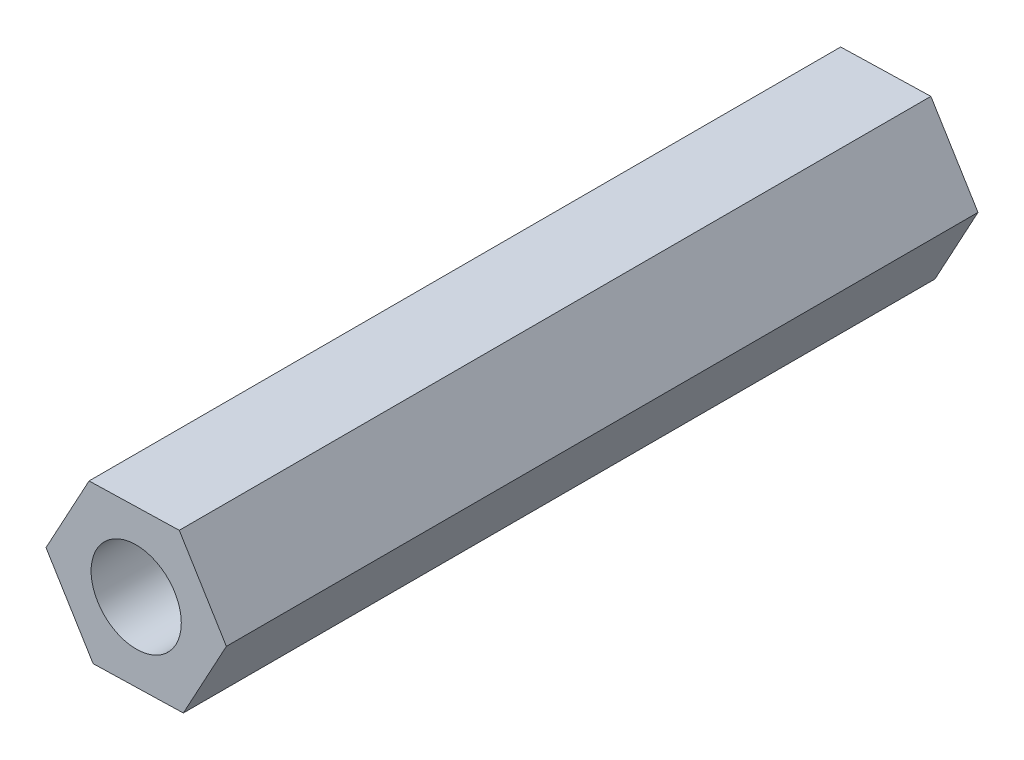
ISO-10303-21;
HEADER;
FILE_DESCRIPTION(('STEP AP214'),'2;1');
FILE_NAME('part.step','',(''),(''),'','','');
FILE_SCHEMA(('AUTOMOTIVE_DESIGN { 1 0 10303 214 1 1 1 1 }'));
ENDSEC;
DATA;
#1=APPLICATION_CONTEXT('core data for automotive mechanical design processes');
#2=APPLICATION_PROTOCOL_DEFINITION('international standard','automotive_design',2000,#1);
#3=PRODUCT_CONTEXT('',#1,'mechanical');
#4=PRODUCT('Part','Part','',(#3));
#5=PRODUCT_RELATED_PRODUCT_CATEGORY('part','',(#4));
#6=PRODUCT_DEFINITION_FORMATION('','',#4);
#7=PRODUCT_DEFINITION_CONTEXT('part definition',#1,'design');
#8=PRODUCT_DEFINITION('design','',#6,#7);
#9=PRODUCT_DEFINITION_SHAPE('','',#8);
#10=(LENGTH_UNIT() NAMED_UNIT(*) SI_UNIT(.MILLI.,.METRE.));
#11=(NAMED_UNIT(*) PLANE_ANGLE_UNIT() SI_UNIT($,.RADIAN.));
#12=(NAMED_UNIT(*) SI_UNIT($,.STERADIAN.) SOLID_ANGLE_UNIT());
#13=UNCERTAINTY_MEASURE_WITH_UNIT(LENGTH_MEASURE(1.E-05),#10,'distance_accuracy_value','');
#14=(GEOMETRIC_REPRESENTATION_CONTEXT(3) GLOBAL_UNCERTAINTY_ASSIGNED_CONTEXT((#13)) GLOBAL_UNIT_ASSIGNED_CONTEXT((#10,
#11,#12)) REPRESENTATION_CONTEXT('',''));
#15=CARTESIAN_POINT('',(0.,0.,0.));
#16=DIRECTION('',(0.,0.,1.));
#17=DIRECTION('',(1.,0.,0.));
#18=AXIS2_PLACEMENT_3D('',#15,#16,#17);
#19=CARTESIAN_POINT('',(1.56754599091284,-2.55907851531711,25.));
#20=DIRECTION('',(0.0259896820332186,-0.999662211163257,0.));
#21=DIRECTION('',(0.999662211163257,0.0259896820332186,0.));
#22=AXIS2_PLACEMENT_3D('',#19,#20,#21);
#23=PLANE('',#22);
#24=DIRECTION('',(-0.999662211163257,-0.0259896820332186,0.));
#25=VECTOR('',#24,1.);
#26=CARTESIAN_POINT('',(1.56754599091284,-2.55907851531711,0.));
#27=LINE('',#26,#25);
#28=CARTESIAN_POINT('',(1.56754599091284,-2.55907851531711,0.));
#29=VERTEX_POINT('',#28);
#30=CARTESIAN_POINT('',(-1.43245400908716,-2.63707390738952,0.));
#31=VERTEX_POINT('',#30);
#32=EDGE_CURVE('E118',#29,#31,#27,.T.);
#33=ORIENTED_EDGE('',*,*,#32,.F.);
#34=DIRECTION('',(0.,0.,-1.));
#35=VECTOR('',#34,1.);
#36=CARTESIAN_POINT('',(1.56754599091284,-2.55907851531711,25.));
#37=LINE('',#36,#35);
#38=CARTESIAN_POINT('',(1.56754599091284,-2.55907851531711,25.));
#39=VERTEX_POINT('',#38);
#40=EDGE_CURVE('E11',#39,#29,#37,.T.);
#41=ORIENTED_EDGE('',*,*,#40,.F.);
#42=DIRECTION('',(-0.999662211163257,-0.0259896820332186,0.));
#43=VECTOR('',#42,1.);
#44=CARTESIAN_POINT('',(1.56754599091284,-2.55907851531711,25.));
#45=LINE('',#44,#43);
#46=CARTESIAN_POINT('',(-1.43245400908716,-2.63707390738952,25.));
#47=VERTEX_POINT('',#46);
#48=EDGE_CURVE('E133',#39,#47,#45,.T.);
#49=ORIENTED_EDGE('',*,*,#48,.T.);
#50=DIRECTION('',(0.,0.,-1.));
#51=VECTOR('',#50,1.);
#52=CARTESIAN_POINT('',(-1.43245400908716,-2.63707390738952,25.));
#53=LINE('',#52,#51);
#54=EDGE_CURVE('E36',#47,#31,#53,.T.);
#55=ORIENTED_EDGE('',*,*,#54,.T.);
#56=EDGE_LOOP('',(#33,#41,#49,#55));
#57=FACE_BOUND('',#56,.T.);
#58=ADVANCED_FACE('F33',(#57),#23,.T.);
#59=CARTESIAN_POINT('',(3.,0.0779953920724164,25.));
#60=DIRECTION('',(0.878727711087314,-0.477323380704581,0.));
#61=DIRECTION('',(0.477323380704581,0.878727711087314,0.));
#62=AXIS2_PLACEMENT_3D('',#59,#60,#61);
#63=PLANE('',#62);
#64=DIRECTION('',(-0.477323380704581,-0.878727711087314,0.));
#65=VECTOR('',#64,1.);
#66=CARTESIAN_POINT('',(3.,0.0779953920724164,0.));
#67=LINE('',#66,#65);
#68=CARTESIAN_POINT('',(3.,0.0779953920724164,0.));
#69=VERTEX_POINT('',#68);
#70=EDGE_CURVE('E131',#69,#29,#67,.T.);
#71=ORIENTED_EDGE('',*,*,#70,.F.);
#72=DIRECTION('',(0.,0.,-1.));
#73=VECTOR('',#72,1.);
#74=CARTESIAN_POINT('',(3.,0.0779953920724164,25.));
#75=LINE('',#74,#73);
#76=CARTESIAN_POINT('',(3.,0.0779953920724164,25.));
#77=VERTEX_POINT('',#76);
#78=EDGE_CURVE('E42',#77,#69,#75,.T.);
#79=ORIENTED_EDGE('',*,*,#78,.F.);
#80=DIRECTION('',(-0.477323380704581,-0.878727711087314,0.));
#81=VECTOR('',#80,1.);
#82=CARTESIAN_POINT('',(3.,0.0779953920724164,25.));
#83=LINE('',#82,#81);
#84=EDGE_CURVE('E108',#77,#39,#83,.T.);
#85=ORIENTED_EDGE('',*,*,#84,.T.);
#86=ORIENTED_EDGE('',*,*,#40,.T.);
#87=EDGE_LOOP('',(#71,#79,#85,#86));
#88=FACE_BOUND('',#87,.T.);
#89=ADVANCED_FACE('F141',(#88),#63,.T.);
#90=CARTESIAN_POINT('',(1.43245400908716,2.63707390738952,25.));
#91=DIRECTION('',(0.852738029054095,0.522338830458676,0.));
#92=DIRECTION('',(-0.522338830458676,0.852738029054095,0.));
#93=AXIS2_PLACEMENT_3D('',#90,#91,#92);
#94=PLANE('',#93);
#95=DIRECTION('',(0.522338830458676,-0.852738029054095,0.));
#96=VECTOR('',#95,1.);
#97=CARTESIAN_POINT('',(1.43245400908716,2.63707390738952,0.));
#98=LINE('',#97,#96);
#99=CARTESIAN_POINT('',(1.43245400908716,2.63707390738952,0.));
#100=VERTEX_POINT('',#99);
#101=EDGE_CURVE('E95',#100,#69,#98,.T.);
#102=ORIENTED_EDGE('',*,*,#101,.F.);
#103=DIRECTION('',(0.,0.,-1.));
#104=VECTOR('',#103,1.);
#105=CARTESIAN_POINT('',(1.43245400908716,2.63707390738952,25.));
#106=LINE('',#105,#104);
#107=CARTESIAN_POINT('',(1.43245400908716,2.63707390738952,25.));
#108=VERTEX_POINT('',#107);
#109=EDGE_CURVE('E90',#108,#100,#106,.T.);
#110=ORIENTED_EDGE('',*,*,#109,.F.);
#111=DIRECTION('',(0.522338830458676,-0.852738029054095,0.));
#112=VECTOR('',#111,1.);
#113=CARTESIAN_POINT('',(1.43245400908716,2.63707390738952,25.));
#114=LINE('',#113,#112);
#115=EDGE_CURVE('E93',#108,#77,#114,.T.);
#116=ORIENTED_EDGE('',*,*,#115,.T.);
#117=ORIENTED_EDGE('',*,*,#78,.T.);
#118=EDGE_LOOP('',(#102,#110,#116,#117));
#119=FACE_BOUND('',#118,.T.);
#120=ADVANCED_FACE('F92',(#119),#94,.T.);
#121=CARTESIAN_POINT('',(-1.56754599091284,2.55907851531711,25.));
#122=DIRECTION('',(-0.0259896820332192,0.999662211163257,0.));
#123=DIRECTION('',(-0.999662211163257,-0.0259896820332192,0.));
#124=AXIS2_PLACEMENT_3D('',#121,#122,#123);
#125=PLANE('',#124);
#126=DIRECTION('',(0.999662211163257,0.0259896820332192,0.));
#127=VECTOR('',#126,1.);
#128=CARTESIAN_POINT('',(-1.56754599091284,2.55907851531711,0.));
#129=LINE('',#128,#127);
#130=CARTESIAN_POINT('',(-1.56754599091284,2.55907851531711,0.));
#131=VERTEX_POINT('',#130);
#132=EDGE_CURVE('E128',#131,#100,#129,.T.);
#133=ORIENTED_EDGE('',*,*,#132,.F.);
#134=DIRECTION('',(0.,0.,-1.));
#135=VECTOR('',#134,1.);
#136=CARTESIAN_POINT('',(-1.56754599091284,2.55907851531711,25.));
#137=LINE('',#136,#135);
#138=CARTESIAN_POINT('',(-1.56754599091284,2.55907851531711,25.));
#139=VERTEX_POINT('',#138);
#140=EDGE_CURVE('E100',#139,#131,#137,.T.);
#141=ORIENTED_EDGE('',*,*,#140,.F.);
#142=DIRECTION('',(0.999662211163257,0.0259896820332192,0.));
#143=VECTOR('',#142,1.);
#144=CARTESIAN_POINT('',(-1.56754599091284,2.55907851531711,25.));
#145=LINE('',#144,#143);
#146=EDGE_CURVE('E106',#139,#108,#145,.T.);
#147=ORIENTED_EDGE('',*,*,#146,.T.);
#148=ORIENTED_EDGE('',*,*,#109,.T.);
#149=EDGE_LOOP('',(#133,#141,#147,#148));
#150=FACE_BOUND('',#149,.T.);
#151=ADVANCED_FACE('F110',(#150),#125,.T.);
#152=CARTESIAN_POINT('',(-3.,-0.0779953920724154,25.));
#153=DIRECTION('',(-0.878727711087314,0.477323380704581,0.));
#154=DIRECTION('',(-0.477323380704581,-0.878727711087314,0.));
#155=AXIS2_PLACEMENT_3D('',#152,#153,#154);
#156=PLANE('',#155);
#157=DIRECTION('',(0.477323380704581,0.878727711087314,0.));
#158=VECTOR('',#157,1.);
#159=CARTESIAN_POINT('',(-3.,-0.0779953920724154,0.));
#160=LINE('',#159,#158);
#161=CARTESIAN_POINT('',(-3.,-0.0779953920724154,0.));
#162=VERTEX_POINT('',#161);
#163=EDGE_CURVE('E125',#162,#131,#160,.T.);
#164=ORIENTED_EDGE('',*,*,#163,.F.);
#165=DIRECTION('',(0.,0.,-1.));
#166=VECTOR('',#165,1.);
#167=CARTESIAN_POINT('',(-3.,-0.0779953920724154,25.));
#168=LINE('',#167,#166);
#169=CARTESIAN_POINT('',(-3.,-0.0779953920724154,25.));
#170=VERTEX_POINT('',#169);
#171=EDGE_CURVE('E136',#170,#162,#168,.T.);
#172=ORIENTED_EDGE('',*,*,#171,.F.);
#173=DIRECTION('',(0.477323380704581,0.878727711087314,0.));
#174=VECTOR('',#173,1.);
#175=CARTESIAN_POINT('',(-3.,-0.0779953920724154,25.));
#176=LINE('',#175,#174);
#177=EDGE_CURVE('E111',#170,#139,#176,.T.);
#178=ORIENTED_EDGE('',*,*,#177,.T.);
#179=ORIENTED_EDGE('',*,*,#140,.T.);
#180=EDGE_LOOP('',(#164,#172,#178,#179));
#181=FACE_BOUND('',#180,.T.);
#182=ADVANCED_FACE('F154',(#181),#156,.T.);
#183=CARTESIAN_POINT('',(-1.43245400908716,-2.63707390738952,25.));
#184=DIRECTION('',(-0.852738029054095,-0.522338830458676,0.));
#185=DIRECTION('',(0.522338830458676,-0.852738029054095,0.));
#186=AXIS2_PLACEMENT_3D('',#183,#184,#185);
#187=PLANE('',#186);
#188=DIRECTION('',(-0.522338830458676,0.852738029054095,0.));
#189=VECTOR('',#188,1.);
#190=CARTESIAN_POINT('',(-1.43245400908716,-2.63707390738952,0.));
#191=LINE('',#190,#189);
#192=EDGE_CURVE('E121',#31,#162,#191,.T.);
#193=ORIENTED_EDGE('',*,*,#192,.F.);
#194=ORIENTED_EDGE('',*,*,#54,.F.);
#195=DIRECTION('',(-0.522338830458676,0.852738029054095,0.));
#196=VECTOR('',#195,1.);
#197=CARTESIAN_POINT('',(-1.43245400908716,-2.63707390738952,25.));
#198=LINE('',#197,#196);
#199=EDGE_CURVE('E113',#47,#170,#198,.T.);
#200=ORIENTED_EDGE('',*,*,#199,.T.);
#201=ORIENTED_EDGE('',*,*,#171,.T.);
#202=EDGE_LOOP('',(#193,#194,#200,#201));
#203=FACE_BOUND('',#202,.T.);
#204=ADVANCED_FACE('F138',(#203),#187,.T.);
#205=CARTESIAN_POINT('',(0.,0.,25.));
#206=DIRECTION('',(0.,0.,-1.));
#207=DIRECTION('',(-1.,0.,0.));
#208=AXIS2_PLACEMENT_3D('',#205,#206,#207);
#209=PLANE('',#208);
#210=CARTESIAN_POINT('',(0.,0.,25.));
#211=DIRECTION('',(0.,0.,-1.));
#212=DIRECTION('',(1.,0.,0.));
#213=AXIS2_PLACEMENT_3D('',#210,#211,#212);
#214=CIRCLE('',#213,1.5);
#215=CARTESIAN_POINT('',(1.5,0.,25.));
#216=VERTEX_POINT('',#215);
#217=EDGE_CURVE('E122',#216,#216,#214,.T.);
#218=ORIENTED_EDGE('',*,*,#217,.T.);
#219=EDGE_LOOP('',(#218));
#220=FACE_BOUND('',#219,.T.);
#221=ORIENTED_EDGE('',*,*,#48,.F.);
#222=ORIENTED_EDGE('',*,*,#84,.F.);
#223=ORIENTED_EDGE('',*,*,#115,.F.);
#224=ORIENTED_EDGE('',*,*,#146,.F.);
#225=ORIENTED_EDGE('',*,*,#177,.F.);
#226=ORIENTED_EDGE('',*,*,#199,.F.);
#227=EDGE_LOOP('',(#221,#222,#223,#224,#225,#226));
#228=FACE_BOUND('',#227,.T.);
#229=ADVANCED_FACE('F104',(#220,#228),#209,.F.);
#230=CARTESIAN_POINT('',(0.,0.,0.));
#231=DIRECTION('',(0.,0.,-1.));
#232=DIRECTION('',(-1.,0.,0.));
#233=AXIS2_PLACEMENT_3D('',#230,#231,#232);
#234=PLANE('',#233);
#235=CARTESIAN_POINT('',(0.,0.,0.));
#236=DIRECTION('',(0.,0.,-1.));
#237=DIRECTION('',(1.,0.,0.));
#238=AXIS2_PLACEMENT_3D('',#235,#236,#237);
#239=CIRCLE('',#238,1.5);
#240=CARTESIAN_POINT('',(1.5,0.,0.));
#241=VERTEX_POINT('',#240);
#242=EDGE_CURVE('E177',#241,#241,#239,.T.);
#243=ORIENTED_EDGE('',*,*,#242,.F.);
#244=EDGE_LOOP('',(#243));
#245=FACE_BOUND('',#244,.T.);
#246=ORIENTED_EDGE('',*,*,#32,.T.);
#247=ORIENTED_EDGE('',*,*,#192,.T.);
#248=ORIENTED_EDGE('',*,*,#163,.T.);
#249=ORIENTED_EDGE('',*,*,#132,.T.);
#250=ORIENTED_EDGE('',*,*,#101,.T.);
#251=ORIENTED_EDGE('',*,*,#70,.T.);
#252=EDGE_LOOP('',(#246,#247,#248,#249,#250,#251));
#253=FACE_BOUND('',#252,.T.);
#254=ADVANCED_FACE('F140',(#245,#253),#234,.T.);
#255=CARTESIAN_POINT('',(0.,0.,25.));
#256=DIRECTION('',(0.,0.,-1.));
#257=DIRECTION('',(-1.,0.,0.));
#258=AXIS2_PLACEMENT_3D('',#255,#256,#257);
#259=CYLINDRICAL_SURFACE('',#258,1.5);
#260=ORIENTED_EDGE('',*,*,#217,.F.);
#261=EDGE_LOOP('',(#260));
#262=FACE_BOUND('',#261,.T.);
#263=ORIENTED_EDGE('',*,*,#242,.T.);
#264=EDGE_LOOP('',(#263));
#265=FACE_BOUND('',#264,.T.);
#266=ADVANCED_FACE('F165',(#262,#265),#259,.F.);
#267=CLOSED_SHELL('',(#58,#89,#120,#151,#182,#204,#229,#254,#266));
#268=MANIFOLD_SOLID_BREP('B2',#267);
#269=ADVANCED_BREP_SHAPE_REPRESENTATION('',(#18,#268),#14);
#270=SHAPE_DEFINITION_REPRESENTATION(#9,#269);
ENDSEC;
END-ISO-10303-21;
